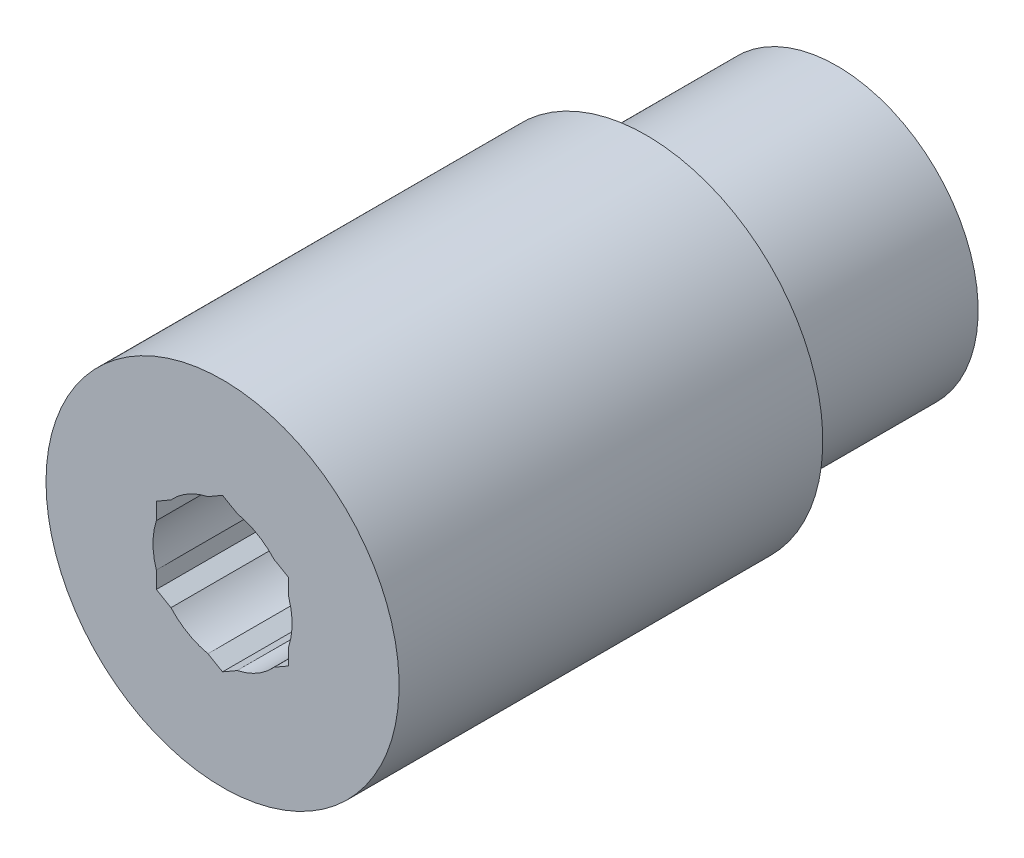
ISO-10303-21;
HEADER;
FILE_DESCRIPTION(('STEP AP214'),'2;1');
FILE_NAME('part.step','',(''),(''),'','','');
FILE_SCHEMA(('AUTOMOTIVE_DESIGN { 1 0 10303 214 1 1 1 1 }'));
ENDSEC;
DATA;
#1=APPLICATION_CONTEXT('core data for automotive mechanical design processes');
#2=APPLICATION_PROTOCOL_DEFINITION('international standard','automotive_design',2000,#1);
#3=PRODUCT_CONTEXT('',#1,'mechanical');
#4=PRODUCT('Part','Part','',(#3));
#5=PRODUCT_RELATED_PRODUCT_CATEGORY('part','',(#4));
#6=PRODUCT_DEFINITION_FORMATION('','',#4);
#7=PRODUCT_DEFINITION_CONTEXT('part definition',#1,'design');
#8=PRODUCT_DEFINITION('design','',#6,#7);
#9=PRODUCT_DEFINITION_SHAPE('','',#8);
#10=(LENGTH_UNIT() NAMED_UNIT(*) SI_UNIT(.MILLI.,.METRE.));
#11=(NAMED_UNIT(*) PLANE_ANGLE_UNIT() SI_UNIT($,.RADIAN.));
#12=(NAMED_UNIT(*) SI_UNIT($,.STERADIAN.) SOLID_ANGLE_UNIT());
#13=UNCERTAINTY_MEASURE_WITH_UNIT(LENGTH_MEASURE(1.E-05),#10,'distance_accuracy_value','');
#14=(GEOMETRIC_REPRESENTATION_CONTEXT(3) GLOBAL_UNCERTAINTY_ASSIGNED_CONTEXT((#13)) GLOBAL_UNIT_ASSIGNED_CONTEXT((#10,
#11,#12)) REPRESENTATION_CONTEXT('',''));
#15=CARTESIAN_POINT('',(0.,0.,0.));
#16=DIRECTION('',(0.,0.,1.));
#17=DIRECTION('',(1.,0.,0.));
#18=AXIS2_PLACEMENT_3D('',#15,#16,#17);
#19=CARTESIAN_POINT('',(0.,0.,-83.4064547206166));
#20=DIRECTION('',(0.,0.,-1.));
#21=DIRECTION('',(-1.,0.,0.));
#22=AXIS2_PLACEMENT_3D('',#19,#20,#21);
#23=CYLINDRICAL_SURFACE('',#22,2.50189999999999);
#24=DIRECTION('',(0.,0.,-1.));
#25=VECTOR('',#24,1.);
#26=CARTESIAN_POINT('',(-0.525896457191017,2.44600419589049,-83.4064547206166));
#27=LINE('',#26,#25);
#28=CARTESIAN_POINT('',(-0.52589645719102,2.44600419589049,36.766363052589));
#29=VERTEX_POINT('',#28);
#30=CARTESIAN_POINT('',(-0.525896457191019,2.44600419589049,14.668363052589));
#31=VERTEX_POINT('',#30);
#32=EDGE_CURVE('E312',#29,#31,#27,.T.);
#33=ORIENTED_EDGE('',*,*,#32,.F.);
#34=CARTESIAN_POINT('',(0.,0.,36.766363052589));
#35=DIRECTION('',(0.,0.,-1.));
#36=DIRECTION('',(-1.,0.,0.));
#37=AXIS2_PLACEMENT_3D('',#34,#35,#36);
#38=CIRCLE('',#37,2.50189999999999);
#39=CARTESIAN_POINT('',(-1.85535354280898,1.6784417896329,36.766363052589));
#40=VERTEX_POINT('',#39);
#41=EDGE_CURVE('E186',#40,#29,#38,.T.);
#42=ORIENTED_EDGE('',*,*,#41,.F.);
#43=DIRECTION('',(0.,0.,-1.));
#44=VECTOR('',#43,1.);
#45=CARTESIAN_POINT('',(-1.85535354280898,1.6784417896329,-83.4064547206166));
#46=LINE('',#45,#44);
#47=CARTESIAN_POINT('',(-1.85535354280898,1.6784417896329,14.668363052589));
#48=VERTEX_POINT('',#47);
#49=EDGE_CURVE('E310',#48,#40,#46,.F.);
#50=ORIENTED_EDGE('',*,*,#49,.F.);
#51=CARTESIAN_POINT('',(0.,0.,14.668363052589));
#52=DIRECTION('',(0.,0.,-1.));
#53=DIRECTION('',(-1.,0.,0.));
#54=AXIS2_PLACEMENT_3D('',#51,#52,#53);
#55=CIRCLE('',#54,2.50189999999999);
#56=EDGE_CURVE('E193',#48,#31,#55,.T.);
#57=ORIENTED_EDGE('',*,*,#56,.T.);
#58=EDGE_LOOP('',(#33,#42,#50,#57));
#59=FACE_BOUND('',#58,.T.);
#60=ADVANCED_FACE('F35',(#59),#23,.F.);
#61=DIRECTION('',(0.,0.,-1.));
#62=VECTOR('',#61,1.);
#63=CARTESIAN_POINT('',(-2.38125,0.767562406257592,-83.4064547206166));
#64=LINE('',#63,#62);
#65=CARTESIAN_POINT('',(-2.38125,0.767562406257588,36.766363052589));
#66=VERTEX_POINT('',#65);
#67=CARTESIAN_POINT('',(-2.38125,0.767562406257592,14.668363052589));
#68=VERTEX_POINT('',#67);
#69=EDGE_CURVE('E308',#66,#68,#64,.T.);
#70=ORIENTED_EDGE('',*,*,#69,.F.);
#71=CARTESIAN_POINT('',(-2.38125,-0.767562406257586,36.766363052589));
#72=VERTEX_POINT('',#71);
#73=EDGE_CURVE('E221',#72,#66,#38,.T.);
#74=ORIENTED_EDGE('',*,*,#73,.F.);
#75=DIRECTION('',(0.,0.,-1.));
#76=VECTOR('',#75,1.);
#77=CARTESIAN_POINT('',(-2.38125,-0.76756240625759,-83.4064547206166));
#78=LINE('',#77,#76);
#79=CARTESIAN_POINT('',(-2.38125,-0.76756240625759,14.668363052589));
#80=VERTEX_POINT('',#79);
#81=EDGE_CURVE('E214',#80,#72,#78,.F.);
#82=ORIENTED_EDGE('',*,*,#81,.F.);
#83=EDGE_CURVE('E230',#80,#68,#55,.T.);
#84=ORIENTED_EDGE('',*,*,#83,.T.);
#85=EDGE_LOOP('',(#70,#74,#82,#84));
#86=FACE_BOUND('',#85,.T.);
#87=ADVANCED_FACE('F337',(#86),#23,.F.);
#88=DIRECTION('',(0.,0.,-1.));
#89=VECTOR('',#88,1.);
#90=CARTESIAN_POINT('',(-1.85535354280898,-1.6784417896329,-83.4064547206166));
#91=LINE('',#90,#89);
#92=CARTESIAN_POINT('',(-1.85535354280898,-1.6784417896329,36.766363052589));
#93=VERTEX_POINT('',#92);
#94=CARTESIAN_POINT('',(-1.85535354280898,-1.6784417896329,14.668363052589));
#95=VERTEX_POINT('',#94);
#96=EDGE_CURVE('E202',#93,#95,#91,.T.);
#97=ORIENTED_EDGE('',*,*,#96,.F.);
#98=CARTESIAN_POINT('',(-0.525896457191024,-2.44600419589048,36.766363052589));
#99=VERTEX_POINT('',#98);
#100=EDGE_CURVE('E211',#99,#93,#38,.T.);
#101=ORIENTED_EDGE('',*,*,#100,.F.);
#102=DIRECTION('',(0.,0.,-1.));
#103=VECTOR('',#102,1.);
#104=CARTESIAN_POINT('',(-0.525896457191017,-2.44600419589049,-83.4064547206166));
#105=LINE('',#104,#103);
#106=CARTESIAN_POINT('',(-0.525896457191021,-2.44600419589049,14.668363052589));
#107=VERTEX_POINT('',#106);
#108=EDGE_CURVE('E215',#107,#99,#105,.F.);
#109=ORIENTED_EDGE('',*,*,#108,.F.);
#110=EDGE_CURVE('E213',#107,#95,#55,.T.);
#111=ORIENTED_EDGE('',*,*,#110,.T.);
#112=EDGE_LOOP('',(#97,#101,#109,#111));
#113=FACE_BOUND('',#112,.T.);
#114=ADVANCED_FACE('F209',(#113),#23,.F.);
#115=DIRECTION('',(0.,0.,-1.));
#116=VECTOR('',#115,1.);
#117=CARTESIAN_POINT('',(0.525896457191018,-2.44600419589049,-83.4064547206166));
#118=LINE('',#117,#116);
#119=CARTESIAN_POINT('',(0.525896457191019,-2.44600419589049,36.766363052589));
#120=VERTEX_POINT('',#119);
#121=CARTESIAN_POINT('',(0.525896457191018,-2.44600419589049,14.668363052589));
#122=VERTEX_POINT('',#121);
#123=EDGE_CURVE('E260',#120,#122,#118,.T.);
#124=ORIENTED_EDGE('',*,*,#123,.F.);
#125=CARTESIAN_POINT('',(1.85535354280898,-1.6784417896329,36.766363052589));
#126=VERTEX_POINT('',#125);
#127=EDGE_CURVE('E220',#126,#120,#38,.T.);
#128=ORIENTED_EDGE('',*,*,#127,.F.);
#129=DIRECTION('',(0.,0.,-1.));
#130=VECTOR('',#129,1.);
#131=CARTESIAN_POINT('',(1.85535354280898,-1.6784417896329,-83.4064547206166));
#132=LINE('',#131,#130);
#133=CARTESIAN_POINT('',(1.85535354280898,-1.6784417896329,14.668363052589));
#134=VERTEX_POINT('',#133);
#135=EDGE_CURVE('E261',#134,#126,#132,.F.);
#136=ORIENTED_EDGE('',*,*,#135,.F.);
#137=EDGE_CURVE('E236',#134,#122,#55,.T.);
#138=ORIENTED_EDGE('',*,*,#137,.T.);
#139=EDGE_LOOP('',(#124,#128,#136,#138));
#140=FACE_BOUND('',#139,.T.);
#141=ADVANCED_FACE('F258',(#140),#23,.F.);
#142=DIRECTION('',(0.,0.,-1.));
#143=VECTOR('',#142,1.);
#144=CARTESIAN_POINT('',(2.38125,-0.767562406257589,-83.4064547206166));
#145=LINE('',#144,#143);
#146=CARTESIAN_POINT('',(2.38125,-0.767562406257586,36.766363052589));
#147=VERTEX_POINT('',#146);
#148=CARTESIAN_POINT('',(2.38125,-0.767562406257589,14.668363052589));
#149=VERTEX_POINT('',#148);
#150=EDGE_CURVE('E302',#147,#149,#145,.T.);
#151=ORIENTED_EDGE('',*,*,#150,.F.);
#152=CARTESIAN_POINT('',(2.38125,0.767562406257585,36.766363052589));
#153=VERTEX_POINT('',#152);
#154=EDGE_CURVE('E224',#153,#147,#38,.T.);
#155=ORIENTED_EDGE('',*,*,#154,.F.);
#156=DIRECTION('',(0.,0.,-1.));
#157=VECTOR('',#156,1.);
#158=CARTESIAN_POINT('',(2.38125,0.767562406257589,-83.4064547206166));
#159=LINE('',#158,#157);
#160=CARTESIAN_POINT('',(2.38125,0.767562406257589,14.668363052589));
#161=VERTEX_POINT('',#160);
#162=EDGE_CURVE('E300',#161,#153,#159,.F.);
#163=ORIENTED_EDGE('',*,*,#162,.F.);
#164=EDGE_CURVE('E244',#161,#149,#55,.T.);
#165=ORIENTED_EDGE('',*,*,#164,.T.);
#166=EDGE_LOOP('',(#151,#155,#163,#165));
#167=FACE_BOUND('',#166,.T.);
#168=ADVANCED_FACE('F335',(#167),#23,.F.);
#169=CARTESIAN_POINT('',(0.,0.,-83.4064547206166));
#170=DIRECTION('',(0.,0.,-1.));
#171=DIRECTION('',(-1.,0.,0.));
#172=AXIS2_PLACEMENT_3D('',#169,#170,#171);
#173=CYLINDRICAL_SURFACE('',#172,5.07999999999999);
#174=CARTESIAN_POINT('',(0.,0.,21.526363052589));
#175=DIRECTION('',(0.,0.,-1.));
#176=DIRECTION('',(-1.,0.,0.));
#177=AXIS2_PLACEMENT_3D('',#174,#175,#176);
#178=CIRCLE('',#177,5.07999999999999);
#179=CARTESIAN_POINT('',(-5.07999999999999,0.,21.526363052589));
#180=VERTEX_POINT('',#179);
#181=EDGE_CURVE('E314',#180,#180,#178,.T.);
#182=ORIENTED_EDGE('',*,*,#181,.T.);
#183=EDGE_LOOP('',(#182));
#184=FACE_BOUND('',#183,.T.);
#185=CARTESIAN_POINT('',(0.,0.,14.668363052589));
#186=DIRECTION('',(0.,0.,-1.));
#187=DIRECTION('',(-1.,0.,0.));
#188=AXIS2_PLACEMENT_3D('',#185,#186,#187);
#189=CIRCLE('',#188,5.07999999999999);
#190=CARTESIAN_POINT('',(-5.07999999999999,0.,14.668363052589));
#191=VERTEX_POINT('',#190);
#192=EDGE_CURVE('E188',#191,#191,#189,.T.);
#193=ORIENTED_EDGE('',*,*,#192,.F.);
#194=EDGE_LOOP('',(#193));
#195=FACE_BOUND('',#194,.T.);
#196=ADVANCED_FACE('F37',(#184,#195),#173,.T.);
#197=CARTESIAN_POINT('',(-5.07999999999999,0.,14.668363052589));
#198=DIRECTION('',(0.,0.,-1.));
#199=DIRECTION('',(-1.,0.,0.));
#200=AXIS2_PLACEMENT_3D('',#197,#198,#199);
#201=PLANE('',#200);
#202=DIRECTION('',(0.866025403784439,0.5,0.));
#203=VECTOR('',#202,1.);
#204=CARTESIAN_POINT('',(-2.38125,1.3748153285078,14.668363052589));
#205=LINE('',#204,#203);
#206=CARTESIAN_POINT('',(-2.38125,1.3748153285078,14.668363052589));
#207=VERTEX_POINT('',#206);
#208=EDGE_CURVE('E391',#207,#48,#205,.T.);
#209=ORIENTED_EDGE('',*,*,#208,.F.);
#210=DIRECTION('',(0.,1.,0.));
#211=VECTOR('',#210,1.);
#212=CARTESIAN_POINT('',(-2.38125,-1.3748153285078,14.668363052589));
#213=LINE('',#212,#211);
#214=EDGE_CURVE('E284',#68,#207,#213,.T.);
#215=ORIENTED_EDGE('',*,*,#214,.F.);
#216=ORIENTED_EDGE('',*,*,#83,.F.);
#217=CARTESIAN_POINT('',(-2.38125,-1.3748153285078,14.668363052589));
#218=VERTEX_POINT('',#217);
#219=EDGE_CURVE('E285',#218,#80,#213,.T.);
#220=ORIENTED_EDGE('',*,*,#219,.F.);
#221=DIRECTION('',(-0.866025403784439,0.5,0.));
#222=VECTOR('',#221,1.);
#223=CARTESIAN_POINT('',(0.,-2.74963065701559,14.668363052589));
#224=LINE('',#223,#222);
#225=EDGE_CURVE('E278',#95,#218,#224,.T.);
#226=ORIENTED_EDGE('',*,*,#225,.F.);
#227=ORIENTED_EDGE('',*,*,#110,.F.);
#228=CARTESIAN_POINT('',(0.,-2.74963065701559,14.668363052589));
#229=VERTEX_POINT('',#228);
#230=EDGE_CURVE('E272',#229,#107,#224,.T.);
#231=ORIENTED_EDGE('',*,*,#230,.F.);
#232=DIRECTION('',(-0.866025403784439,-0.5,0.));
#233=VECTOR('',#232,1.);
#234=CARTESIAN_POINT('',(2.38125,-1.3748153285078,14.668363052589));
#235=LINE('',#234,#233);
#236=EDGE_CURVE('E271',#122,#229,#235,.T.);
#237=ORIENTED_EDGE('',*,*,#236,.F.);
#238=ORIENTED_EDGE('',*,*,#137,.F.);
#239=CARTESIAN_POINT('',(2.38125,-1.3748153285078,14.668363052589));
#240=VERTEX_POINT('',#239);
#241=EDGE_CURVE('E269',#240,#134,#235,.T.);
#242=ORIENTED_EDGE('',*,*,#241,.F.);
#243=DIRECTION('',(0.,-1.,0.));
#244=VECTOR('',#243,1.);
#245=CARTESIAN_POINT('',(2.38125,1.3748153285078,14.668363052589));
#246=LINE('',#245,#244);
#247=EDGE_CURVE('E279',#149,#240,#246,.T.);
#248=ORIENTED_EDGE('',*,*,#247,.F.);
#249=ORIENTED_EDGE('',*,*,#164,.F.);
#250=CARTESIAN_POINT('',(2.38125,1.3748153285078,14.668363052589));
#251=VERTEX_POINT('',#250);
#252=EDGE_CURVE('E276',#251,#161,#246,.T.);
#253=ORIENTED_EDGE('',*,*,#252,.F.);
#254=DIRECTION('',(0.866025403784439,-0.5,0.));
#255=VECTOR('',#254,1.);
#256=CARTESIAN_POINT('',(0.,2.74963065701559,14.668363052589));
#257=LINE('',#256,#255);
#258=CARTESIAN_POINT('',(1.85535354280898,1.6784417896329,14.668363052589));
#259=VERTEX_POINT('',#258);
#260=EDGE_CURVE('E392',#259,#251,#257,.T.);
#261=ORIENTED_EDGE('',*,*,#260,.F.);
#262=CARTESIAN_POINT('',(0.52589645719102,2.44600419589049,14.668363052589));
#263=VERTEX_POINT('',#262);
#264=EDGE_CURVE('E239',#263,#259,#55,.T.);
#265=ORIENTED_EDGE('',*,*,#264,.F.);
#266=CARTESIAN_POINT('',(0.,2.74963065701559,14.668363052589));
#267=VERTEX_POINT('',#266);
#268=EDGE_CURVE('E394',#267,#263,#257,.T.);
#269=ORIENTED_EDGE('',*,*,#268,.F.);
#270=EDGE_CURVE('E167',#31,#267,#205,.T.);
#271=ORIENTED_EDGE('',*,*,#270,.F.);
#272=ORIENTED_EDGE('',*,*,#56,.F.);
#273=EDGE_LOOP('',(#209,#215,#216,#220,#226,#227,#231,#237,#238,#242,#248,#249,#253,#261,#265,
#269,#271,#272));
#274=FACE_BOUND('',#273,.T.);
#275=ORIENTED_EDGE('',*,*,#192,.T.);
#276=EDGE_LOOP('',(#275));
#277=FACE_BOUND('',#276,.T.);
#278=ADVANCED_FACE('F266',(#274,#277),#201,.T.);
#279=DIRECTION('',(0.,0.,-1.));
#280=VECTOR('',#279,1.);
#281=CARTESIAN_POINT('',(1.85535354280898,1.6784417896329,-83.4064547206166));
#282=LINE('',#281,#280);
#283=CARTESIAN_POINT('',(1.85535354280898,1.6784417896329,36.766363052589));
#284=VERTEX_POINT('',#283);
#285=EDGE_CURVE('E298',#284,#259,#282,.T.);
#286=ORIENTED_EDGE('',*,*,#285,.F.);
#287=CARTESIAN_POINT('',(0.525896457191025,2.44600419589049,36.766363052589));
#288=VERTEX_POINT('',#287);
#289=EDGE_CURVE('E237',#288,#284,#38,.T.);
#290=ORIENTED_EDGE('',*,*,#289,.F.);
#291=DIRECTION('',(0.,0.,-1.));
#292=VECTOR('',#291,1.);
#293=CARTESIAN_POINT('',(0.525896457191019,2.44600419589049,-83.4064547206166));
#294=LINE('',#293,#292);
#295=EDGE_CURVE('E176',#263,#288,#294,.F.);
#296=ORIENTED_EDGE('',*,*,#295,.F.);
#297=ORIENTED_EDGE('',*,*,#264,.T.);
#298=EDGE_LOOP('',(#286,#290,#296,#297));
#299=FACE_BOUND('',#298,.T.);
#300=ADVANCED_FACE('F326',(#299),#23,.F.);
#301=CARTESIAN_POINT('',(-2.50189999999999,0.,36.766363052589));
#302=DIRECTION('',(0.,0.,1.));
#303=DIRECTION('',(1.,0.,0.));
#304=AXIS2_PLACEMENT_3D('',#301,#302,#303);
#305=PLANE('',#304);
#306=DIRECTION('',(0.866025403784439,0.5,0.));
#307=VECTOR('',#306,1.);
#308=CARTESIAN_POINT('',(-2.38125,1.3748153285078,36.766363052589));
#309=LINE('',#308,#307);
#310=CARTESIAN_POINT('',(-2.38125,1.3748153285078,36.766363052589));
#311=VERTEX_POINT('',#310);
#312=EDGE_CURVE('E50',#311,#40,#309,.T.);
#313=ORIENTED_EDGE('',*,*,#312,.T.);
#314=ORIENTED_EDGE('',*,*,#41,.T.);
#315=DIRECTION('',(-0.866025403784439,-0.5,0.));
#316=VECTOR('',#315,1.);
#317=CARTESIAN_POINT('',(-3.06704999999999,0.978868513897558,36.766363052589));
#318=LINE('',#317,#316);
#319=CARTESIAN_POINT('',(0.,2.74963065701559,36.766363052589));
#320=VERTEX_POINT('',#319);
#321=EDGE_CURVE('E164',#320,#29,#318,.T.);
#322=ORIENTED_EDGE('',*,*,#321,.F.);
#323=DIRECTION('',(0.866025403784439,-0.5,0.));
#324=VECTOR('',#323,1.);
#325=CARTESIAN_POINT('',(0.,2.74963065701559,36.766363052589));
#326=LINE('',#325,#324);
#327=EDGE_CURVE('E173',#320,#288,#326,.T.);
#328=ORIENTED_EDGE('',*,*,#327,.T.);
#329=ORIENTED_EDGE('',*,*,#289,.T.);
#330=DIRECTION('',(-0.866025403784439,0.5,0.));
#331=VECTOR('',#330,1.);
#332=CARTESIAN_POINT('',(-0.685799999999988,3.14557747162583,36.766363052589));
#333=LINE('',#332,#331);
#334=CARTESIAN_POINT('',(2.38125,1.3748153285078,36.766363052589));
#335=VERTEX_POINT('',#334);
#336=EDGE_CURVE('E187',#335,#284,#333,.T.);
#337=ORIENTED_EDGE('',*,*,#336,.F.);
#338=DIRECTION('',(0.,-1.,0.));
#339=VECTOR('',#338,1.);
#340=CARTESIAN_POINT('',(2.38125,1.3748153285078,36.766363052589));
#341=LINE('',#340,#339);
#342=EDGE_CURVE('E180',#335,#153,#341,.T.);
#343=ORIENTED_EDGE('',*,*,#342,.T.);
#344=ORIENTED_EDGE('',*,*,#154,.T.);
#345=DIRECTION('',(0.,1.,0.));
#346=VECTOR('',#345,1.);
#347=CARTESIAN_POINT('',(2.38125,0.,36.766363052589));
#348=LINE('',#347,#346);
#349=CARTESIAN_POINT('',(2.38125,-1.3748153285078,36.766363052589));
#350=VERTEX_POINT('',#349);
#351=EDGE_CURVE('E190',#350,#147,#348,.T.);
#352=ORIENTED_EDGE('',*,*,#351,.F.);
#353=DIRECTION('',(-0.866025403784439,-0.5,0.));
#354=VECTOR('',#353,1.);
#355=CARTESIAN_POINT('',(2.38125,-1.3748153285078,36.766363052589));
#356=LINE('',#355,#354);
#357=EDGE_CURVE('E400',#350,#126,#356,.T.);
#358=ORIENTED_EDGE('',*,*,#357,.T.);
#359=ORIENTED_EDGE('',*,*,#127,.T.);
#360=DIRECTION('',(0.866025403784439,0.5,0.));
#361=VECTOR('',#360,1.);
#362=CARTESIAN_POINT('',(-0.685799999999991,-3.14557747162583,36.766363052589));
#363=LINE('',#362,#361);
#364=CARTESIAN_POINT('',(0.,-2.74963065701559,36.766363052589));
#365=VERTEX_POINT('',#364);
#366=EDGE_CURVE('E197',#365,#120,#363,.T.);
#367=ORIENTED_EDGE('',*,*,#366,.F.);
#368=DIRECTION('',(-0.866025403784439,0.5,0.));
#369=VECTOR('',#368,1.);
#370=CARTESIAN_POINT('',(0.,-2.74963065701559,36.766363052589));
#371=LINE('',#370,#369);
#372=EDGE_CURVE('E219',#365,#99,#371,.T.);
#373=ORIENTED_EDGE('',*,*,#372,.T.);
#374=ORIENTED_EDGE('',*,*,#100,.T.);
#375=DIRECTION('',(0.866025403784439,-0.5,0.));
#376=VECTOR('',#375,1.);
#377=CARTESIAN_POINT('',(-3.06704999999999,-0.978868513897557,36.766363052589));
#378=LINE('',#377,#376);
#379=CARTESIAN_POINT('',(-2.38125,-1.3748153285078,36.766363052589));
#380=VERTEX_POINT('',#379);
#381=EDGE_CURVE('E43',#380,#93,#378,.T.);
#382=ORIENTED_EDGE('',*,*,#381,.F.);
#383=DIRECTION('',(0.,1.,0.));
#384=VECTOR('',#383,1.);
#385=CARTESIAN_POINT('',(-2.38125,-1.3748153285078,36.766363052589));
#386=LINE('',#385,#384);
#387=EDGE_CURVE('E58',#380,#72,#386,.T.);
#388=ORIENTED_EDGE('',*,*,#387,.T.);
#389=ORIENTED_EDGE('',*,*,#73,.T.);
#390=DIRECTION('',(0.,-1.,0.));
#391=VECTOR('',#390,1.);
#392=CARTESIAN_POINT('',(-2.38125,0.,36.766363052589));
#393=LINE('',#392,#391);
#394=EDGE_CURVE('E11',#311,#66,#393,.T.);
#395=ORIENTED_EDGE('',*,*,#394,.F.);
#396=EDGE_LOOP('',(#313,#314,#322,#328,#329,#337,#343,#344,#352,#358,#359,#367,#373,#374,#382,
#388,#389,#395));
#397=FACE_BOUND('',#396,.T.);
#398=CARTESIAN_POINT('',(0.,0.,36.766363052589));
#399=DIRECTION('',(0.,0.,-1.));
#400=DIRECTION('',(-1.,0.,0.));
#401=AXIS2_PLACEMENT_3D('',#398,#399,#400);
#402=CIRCLE('',#401,6.34999999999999);
#403=CARTESIAN_POINT('',(-6.34999999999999,0.,36.766363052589));
#404=VERTEX_POINT('',#403);
#405=EDGE_CURVE('E226',#404,#404,#402,.T.);
#406=ORIENTED_EDGE('',*,*,#405,.F.);
#407=EDGE_LOOP('',(#406));
#408=FACE_BOUND('',#407,.T.);
#409=ADVANCED_FACE('F183',(#397,#408),#305,.T.);
#410=CARTESIAN_POINT('',(0.,0.,-83.4064547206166));
#411=DIRECTION('',(0.,0.,-1.));
#412=DIRECTION('',(-1.,0.,0.));
#413=AXIS2_PLACEMENT_3D('',#410,#411,#412);
#414=CYLINDRICAL_SURFACE('',#413,6.34999999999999);
#415=ORIENTED_EDGE('',*,*,#405,.T.);
#416=EDGE_LOOP('',(#415));
#417=FACE_BOUND('',#416,.T.);
#418=CARTESIAN_POINT('',(0.,0.,21.526363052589));
#419=DIRECTION('',(0.,0.,-1.));
#420=DIRECTION('',(-1.,0.,0.));
#421=AXIS2_PLACEMENT_3D('',#418,#419,#420);
#422=CIRCLE('',#421,6.34999999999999);
#423=CARTESIAN_POINT('',(-6.34999999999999,0.,21.526363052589));
#424=VERTEX_POINT('',#423);
#425=EDGE_CURVE('E316',#424,#424,#422,.T.);
#426=ORIENTED_EDGE('',*,*,#425,.F.);
#427=EDGE_LOOP('',(#426));
#428=FACE_BOUND('',#427,.T.);
#429=ADVANCED_FACE('F323',(#417,#428),#414,.T.);
#430=CARTESIAN_POINT('',(-6.34999999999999,0.,21.526363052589));
#431=DIRECTION('',(0.,0.,-1.));
#432=DIRECTION('',(-1.,0.,0.));
#433=AXIS2_PLACEMENT_3D('',#430,#431,#432);
#434=PLANE('',#433);
#435=ORIENTED_EDGE('',*,*,#425,.T.);
#436=EDGE_LOOP('',(#435));
#437=FACE_BOUND('',#436,.T.);
#438=ORIENTED_EDGE('',*,*,#181,.F.);
#439=EDGE_LOOP('',(#438));
#440=FACE_BOUND('',#439,.T.);
#441=ADVANCED_FACE('F332',(#437,#440),#434,.T.);
#442=CARTESIAN_POINT('',(0.,2.74963065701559,36.766363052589));
#443=DIRECTION('',(0.5,0.866025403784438,0.));
#444=DIRECTION('',(-0.866025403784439,0.5,0.));
#445=AXIS2_PLACEMENT_3D('',#442,#443,#444);
#446=PLANE('',#445);
#447=ORIENTED_EDGE('',*,*,#295,.T.);
#448=ORIENTED_EDGE('',*,*,#327,.F.);
#449=DIRECTION('',(0.,0.,-1.));
#450=VECTOR('',#449,1.);
#451=CARTESIAN_POINT('',(0.,2.74963065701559,36.766363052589));
#452=LINE('',#451,#450);
#453=EDGE_CURVE('E160',#320,#267,#452,.T.);
#454=ORIENTED_EDGE('',*,*,#453,.T.);
#455=ORIENTED_EDGE('',*,*,#268,.T.);
#456=EDGE_LOOP('',(#447,#448,#454,#455));
#457=FACE_BOUND('',#456,.T.);
#458=ADVANCED_FACE('F174',(#457),#446,.F.);
#459=CARTESIAN_POINT('',(-2.38125,1.3748153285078,36.766363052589));
#460=DIRECTION('',(-0.5,0.866025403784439,0.));
#461=DIRECTION('',(-0.866025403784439,-0.5,0.));
#462=AXIS2_PLACEMENT_3D('',#459,#460,#461);
#463=PLANE('',#462);
#464=ORIENTED_EDGE('',*,*,#32,.T.);
#465=ORIENTED_EDGE('',*,*,#270,.T.);
#466=ORIENTED_EDGE('',*,*,#453,.F.);
#467=ORIENTED_EDGE('',*,*,#321,.T.);
#468=EDGE_LOOP('',(#464,#465,#466,#467));
#469=FACE_BOUND('',#468,.T.);
#470=ADVANCED_FACE('F162',(#469),#463,.F.);
#471=ORIENTED_EDGE('',*,*,#285,.T.);
#472=ORIENTED_EDGE('',*,*,#260,.T.);
#473=DIRECTION('',(0.,0.,-1.));
#474=VECTOR('',#473,1.);
#475=CARTESIAN_POINT('',(2.38125,1.3748153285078,36.766363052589));
#476=LINE('',#475,#474);
#477=EDGE_CURVE('E170',#335,#251,#476,.T.);
#478=ORIENTED_EDGE('',*,*,#477,.F.);
#479=ORIENTED_EDGE('',*,*,#336,.T.);
#480=EDGE_LOOP('',(#471,#472,#478,#479));
#481=FACE_BOUND('',#480,.T.);
#482=ADVANCED_FACE('F359',(#481),#446,.F.);
#483=CARTESIAN_POINT('',(2.38125,1.3748153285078,36.766363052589));
#484=DIRECTION('',(1.,0.,0.));
#485=DIRECTION('',(0.,0.,-1.));
#486=AXIS2_PLACEMENT_3D('',#483,#484,#485);
#487=PLANE('',#486);
#488=ORIENTED_EDGE('',*,*,#162,.T.);
#489=ORIENTED_EDGE('',*,*,#342,.F.);
#490=ORIENTED_EDGE('',*,*,#477,.T.);
#491=ORIENTED_EDGE('',*,*,#252,.T.);
#492=EDGE_LOOP('',(#488,#489,#490,#491));
#493=FACE_BOUND('',#492,.T.);
#494=ADVANCED_FACE('F365',(#493),#487,.F.);
#495=ORIENTED_EDGE('',*,*,#150,.T.);
#496=ORIENTED_EDGE('',*,*,#247,.T.);
#497=DIRECTION('',(0.,0.,-1.));
#498=VECTOR('',#497,1.);
#499=CARTESIAN_POINT('',(2.38125,-1.3748153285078,36.766363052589));
#500=LINE('',#499,#498);
#501=EDGE_CURVE('E292',#350,#240,#500,.T.);
#502=ORIENTED_EDGE('',*,*,#501,.F.);
#503=ORIENTED_EDGE('',*,*,#351,.T.);
#504=EDGE_LOOP('',(#495,#496,#502,#503));
#505=FACE_BOUND('',#504,.T.);
#506=ADVANCED_FACE('F368',(#505),#487,.F.);
#507=CARTESIAN_POINT('',(2.38125,-1.3748153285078,36.766363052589));
#508=DIRECTION('',(0.5,-0.866025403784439,0.));
#509=DIRECTION('',(0.866025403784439,0.5,0.));
#510=AXIS2_PLACEMENT_3D('',#507,#508,#509);
#511=PLANE('',#510);
#512=ORIENTED_EDGE('',*,*,#135,.T.);
#513=ORIENTED_EDGE('',*,*,#357,.F.);
#514=ORIENTED_EDGE('',*,*,#501,.T.);
#515=ORIENTED_EDGE('',*,*,#241,.T.);
#516=EDGE_LOOP('',(#512,#513,#514,#515));
#517=FACE_BOUND('',#516,.T.);
#518=ADVANCED_FACE('F370',(#517),#511,.F.);
#519=ORIENTED_EDGE('',*,*,#123,.T.);
#520=ORIENTED_EDGE('',*,*,#236,.T.);
#521=DIRECTION('',(0.,0.,-1.));
#522=VECTOR('',#521,1.);
#523=CARTESIAN_POINT('',(0.,-2.74963065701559,36.766363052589));
#524=LINE('',#523,#522);
#525=EDGE_CURVE('E290',#365,#229,#524,.T.);
#526=ORIENTED_EDGE('',*,*,#525,.F.);
#527=ORIENTED_EDGE('',*,*,#366,.T.);
#528=EDGE_LOOP('',(#519,#520,#526,#527));
#529=FACE_BOUND('',#528,.T.);
#530=ADVANCED_FACE('F373',(#529),#511,.F.);
#531=CARTESIAN_POINT('',(0.,-2.74963065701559,36.766363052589));
#532=DIRECTION('',(-0.5,-0.866025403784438,0.));
#533=DIRECTION('',(0.866025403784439,-0.5,0.));
#534=AXIS2_PLACEMENT_3D('',#531,#532,#533);
#535=PLANE('',#534);
#536=ORIENTED_EDGE('',*,*,#108,.T.);
#537=ORIENTED_EDGE('',*,*,#372,.F.);
#538=ORIENTED_EDGE('',*,*,#525,.T.);
#539=ORIENTED_EDGE('',*,*,#230,.T.);
#540=EDGE_LOOP('',(#536,#537,#538,#539));
#541=FACE_BOUND('',#540,.T.);
#542=ADVANCED_FACE('F375',(#541),#535,.F.);
#543=ORIENTED_EDGE('',*,*,#96,.T.);
#544=ORIENTED_EDGE('',*,*,#225,.T.);
#545=DIRECTION('',(0.,0.,-1.));
#546=VECTOR('',#545,1.);
#547=CARTESIAN_POINT('',(-2.38125,-1.3748153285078,36.766363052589));
#548=LINE('',#547,#546);
#549=EDGE_CURVE('E204',#380,#218,#548,.T.);
#550=ORIENTED_EDGE('',*,*,#549,.F.);
#551=ORIENTED_EDGE('',*,*,#381,.T.);
#552=EDGE_LOOP('',(#543,#544,#550,#551));
#553=FACE_BOUND('',#552,.T.);
#554=ADVANCED_FACE('F201',(#553),#535,.F.);
#555=CARTESIAN_POINT('',(-2.38125,-1.3748153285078,36.766363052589));
#556=DIRECTION('',(-1.,0.,0.));
#557=DIRECTION('',(0.,-1.,0.));
#558=AXIS2_PLACEMENT_3D('',#555,#556,#557);
#559=PLANE('',#558);
#560=ORIENTED_EDGE('',*,*,#81,.T.);
#561=ORIENTED_EDGE('',*,*,#387,.F.);
#562=ORIENTED_EDGE('',*,*,#549,.T.);
#563=ORIENTED_EDGE('',*,*,#219,.T.);
#564=EDGE_LOOP('',(#560,#561,#562,#563));
#565=FACE_BOUND('',#564,.T.);
#566=ADVANCED_FACE('F379',(#565),#559,.F.);
#567=ORIENTED_EDGE('',*,*,#69,.T.);
#568=ORIENTED_EDGE('',*,*,#214,.T.);
#569=DIRECTION('',(0.,0.,-1.));
#570=VECTOR('',#569,1.);
#571=CARTESIAN_POINT('',(-2.38125,1.3748153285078,36.766363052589));
#572=LINE('',#571,#570);
#573=EDGE_CURVE('E287',#311,#207,#572,.T.);
#574=ORIENTED_EDGE('',*,*,#573,.F.);
#575=ORIENTED_EDGE('',*,*,#394,.T.);
#576=EDGE_LOOP('',(#567,#568,#574,#575));
#577=FACE_BOUND('',#576,.T.);
#578=ADVANCED_FACE('F363',(#577),#559,.F.);
#579=ORIENTED_EDGE('',*,*,#49,.T.);
#580=ORIENTED_EDGE('',*,*,#312,.F.);
#581=ORIENTED_EDGE('',*,*,#573,.T.);
#582=ORIENTED_EDGE('',*,*,#208,.T.);
#583=EDGE_LOOP('',(#579,#580,#581,#582));
#584=FACE_BOUND('',#583,.T.);
#585=ADVANCED_FACE('F361',(#584),#463,.F.);
#586=CLOSED_SHELL('',(#60,#87,#114,#141,#168,#196,#278,#300,#409,#429,#441,#458,#470,#482,#494,
#506,#518,#530,#542,#554,#566,#578,#585));
#587=MANIFOLD_SOLID_BREP('B2',#586);
#588=ADVANCED_BREP_SHAPE_REPRESENTATION('',(#18,#587),#14);
#589=SHAPE_DEFINITION_REPRESENTATION(#9,#588);
ENDSEC;
END-ISO-10303-21;
